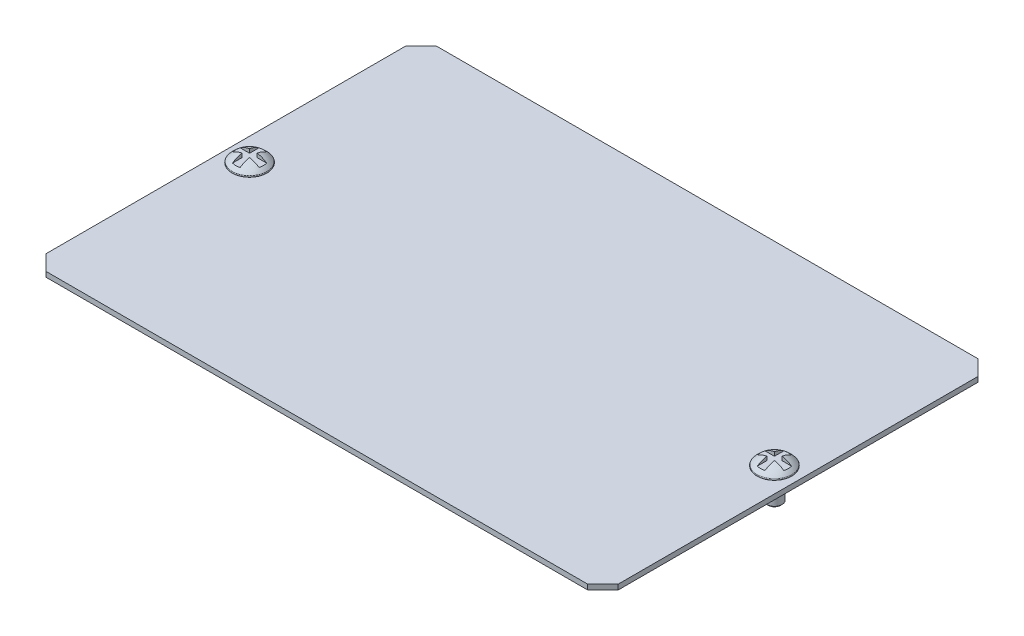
ISO-10303-21;
HEADER;
FILE_DESCRIPTION(('STEP AP214'),'2;1');
FILE_NAME('part.step','',(''),(''),'','','');
FILE_SCHEMA(('AUTOMOTIVE_DESIGN { 1 0 10303 214 1 1 1 1 }'));
ENDSEC;
DATA;
#1=APPLICATION_CONTEXT('core data for automotive mechanical design processes');
#2=APPLICATION_PROTOCOL_DEFINITION('international standard','automotive_design',2000,#1);
#3=PRODUCT_CONTEXT('',#1,'mechanical');
#4=PRODUCT('Part','Part','',(#3));
#5=PRODUCT_RELATED_PRODUCT_CATEGORY('part','',(#4));
#6=PRODUCT_DEFINITION_FORMATION('','',#4);
#7=PRODUCT_DEFINITION_CONTEXT('part definition',#1,'design');
#8=PRODUCT_DEFINITION('design','',#6,#7);
#9=PRODUCT_DEFINITION_SHAPE('','',#8);
#10=(LENGTH_UNIT() NAMED_UNIT(*) SI_UNIT(.MILLI.,.METRE.));
#11=(NAMED_UNIT(*) PLANE_ANGLE_UNIT() SI_UNIT($,.RADIAN.));
#12=(NAMED_UNIT(*) SI_UNIT($,.STERADIAN.) SOLID_ANGLE_UNIT());
#13=UNCERTAINTY_MEASURE_WITH_UNIT(LENGTH_MEASURE(1.E-05),#10,'distance_accuracy_value','');
#14=(GEOMETRIC_REPRESENTATION_CONTEXT(3) GLOBAL_UNCERTAINTY_ASSIGNED_CONTEXT((#13)) GLOBAL_UNIT_ASSIGNED_CONTEXT((#10,
#11,#12)) REPRESENTATION_CONTEXT('',''));
#15=CARTESIAN_POINT('',(0.,0.,0.));
#16=DIRECTION('',(0.,0.,1.));
#17=DIRECTION('',(1.,0.,0.));
#18=AXIS2_PLACEMENT_3D('',#15,#16,#17);
#19=CARTESIAN_POINT('',(0.,1.,0.));
#20=DIRECTION('',(0.,-1.,0.));
#21=DIRECTION('',(0.,0.,-1.));
#22=AXIS2_PLACEMENT_3D('',#19,#20,#21);
#23=PLANE('',#22);
#24=CARTESIAN_POINT('',(51.5,1.,0.));
#25=DIRECTION('',(0.,1.,0.));
#26=DIRECTION('',(1.,0.,0.));
#27=AXIS2_PLACEMENT_3D('',#24,#25,#26);
#28=CIRCLE('',#27,3.23865308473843);
#29=CARTESIAN_POINT('',(54.7386530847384,0.999999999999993,0.));
#30=VERTEX_POINT('',#29);
#31=EDGE_CURVE('E295',#30,#30,#28,.T.);
#32=ORIENTED_EDGE('',*,*,#31,.F.);
#33=EDGE_LOOP('',(#32));
#34=FACE_BOUND('',#33,.T.);
#35=CARTESIAN_POINT('',(-51.4999999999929,1.00000000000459,-1.79184775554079E-12));
#36=DIRECTION('',(0.,1.,0.));
#37=DIRECTION('',(0.,0.,-1.));
#38=AXIS2_PLACEMENT_3D('',#35,#36,#37);
#39=CIRCLE('',#38,3.23865308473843);
#40=CARTESIAN_POINT('',(-51.4999999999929,1.00000000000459,-3.23865308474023));
#41=VERTEX_POINT('',#40);
#42=EDGE_CURVE('E211',#41,#41,#39,.T.);
#43=ORIENTED_EDGE('',*,*,#42,.F.);
#44=EDGE_LOOP('',(#43));
#45=FACE_BOUND('',#44,.T.);
#46=DIRECTION('',(-1.,0.,0.));
#47=VECTOR('',#46,1.);
#48=CARTESIAN_POINT('',(-53.15,1.,-38.3));
#49=LINE('',#48,#47);
#50=CARTESIAN_POINT('',(53.15,1.,-38.3));
#51=VERTEX_POINT('',#50);
#52=CARTESIAN_POINT('',(-53.15,1.,-38.3));
#53=VERTEX_POINT('',#52);
#54=EDGE_CURVE('E130',#51,#53,#49,.T.);
#55=ORIENTED_EDGE('',*,*,#54,.T.);
#56=DIRECTION('',(-0.707106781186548,0.,0.707106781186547));
#57=VECTOR('',#56,1.);
#58=CARTESIAN_POINT('',(-56.15,1.,-35.3));
#59=LINE('',#58,#57);
#60=CARTESIAN_POINT('',(-56.15,1.,-35.3));
#61=VERTEX_POINT('',#60);
#62=EDGE_CURVE('E77',#53,#61,#59,.T.);
#63=ORIENTED_EDGE('',*,*,#62,.T.);
#64=DIRECTION('',(0.,0.,1.));
#65=VECTOR('',#64,1.);
#66=CARTESIAN_POINT('',(-56.15,1.,-35.3));
#67=LINE('',#66,#65);
#68=CARTESIAN_POINT('',(-56.15,1.,35.3));
#69=VERTEX_POINT('',#68);
#70=EDGE_CURVE('E145',#61,#69,#67,.T.);
#71=ORIENTED_EDGE('',*,*,#70,.T.);
#72=DIRECTION('',(0.707106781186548,0.,0.707106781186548));
#73=VECTOR('',#72,1.);
#74=CARTESIAN_POINT('',(-56.15,1.,35.3));
#75=LINE('',#74,#73);
#76=CARTESIAN_POINT('',(-53.15,1.,38.3));
#77=VERTEX_POINT('',#76);
#78=EDGE_CURVE('E158',#69,#77,#75,.T.);
#79=ORIENTED_EDGE('',*,*,#78,.T.);
#80=DIRECTION('',(1.,0.,0.));
#81=VECTOR('',#80,1.);
#82=CARTESIAN_POINT('',(-53.15,1.,38.3));
#83=LINE('',#82,#81);
#84=CARTESIAN_POINT('',(53.15,1.,38.3));
#85=VERTEX_POINT('',#84);
#86=EDGE_CURVE('E97',#77,#85,#83,.T.);
#87=ORIENTED_EDGE('',*,*,#86,.T.);
#88=DIRECTION('',(0.707106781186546,0.,-0.707106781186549));
#89=VECTOR('',#88,1.);
#90=CARTESIAN_POINT('',(53.15,1.,38.3));
#91=LINE('',#90,#89);
#92=CARTESIAN_POINT('',(56.15,1.,35.3));
#93=VERTEX_POINT('',#92);
#94=EDGE_CURVE('E92',#85,#93,#91,.T.);
#95=ORIENTED_EDGE('',*,*,#94,.T.);
#96=DIRECTION('',(0.,0.,-1.));
#97=VECTOR('',#96,1.);
#98=CARTESIAN_POINT('',(56.15,1.,-35.3));
#99=LINE('',#98,#97);
#100=CARTESIAN_POINT('',(56.15,1.,-35.3));
#101=VERTEX_POINT('',#100);
#102=EDGE_CURVE('E95',#93,#101,#99,.T.);
#103=ORIENTED_EDGE('',*,*,#102,.T.);
#104=DIRECTION('',(-0.70710678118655,0.,-0.707106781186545));
#105=VECTOR('',#104,1.);
#106=CARTESIAN_POINT('',(53.15,1.,-38.3));
#107=LINE('',#106,#105);
#108=EDGE_CURVE('E33',#101,#51,#107,.T.);
#109=ORIENTED_EDGE('',*,*,#108,.T.);
#110=EDGE_LOOP('',(#55,#63,#71,#79,#87,#95,#103,#109));
#111=FACE_BOUND('',#110,.T.);
#112=ADVANCED_FACE('F16',(#34,#45,#111),#23,.F.);
#113=CARTESIAN_POINT('',(0.,0.,0.));
#114=DIRECTION('',(0.,-1.,0.));
#115=DIRECTION('',(0.,0.,-1.));
#116=AXIS2_PLACEMENT_3D('',#113,#114,#115);
#117=PLANE('',#116);
#118=CARTESIAN_POINT('',(51.5,0.,0.));
#119=DIRECTION('',(0.,1.,0.));
#120=DIRECTION('',(0.,0.,-1.));
#121=AXIS2_PLACEMENT_3D('',#118,#119,#120);
#122=CIRCLE('',#121,1.9);
#123=CARTESIAN_POINT('',(51.5,0.,-1.90000000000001));
#124=VERTEX_POINT('',#123);
#125=EDGE_CURVE('E119',#124,#124,#122,.T.);
#126=ORIENTED_EDGE('',*,*,#125,.T.);
#127=EDGE_LOOP('',(#126));
#128=FACE_BOUND('',#127,.T.);
#129=DIRECTION('',(-1.,0.,0.));
#130=VECTOR('',#129,1.);
#131=CARTESIAN_POINT('',(-53.15,0.,-38.3));
#132=LINE('',#131,#130);
#133=CARTESIAN_POINT('',(53.15,0.,-38.3));
#134=VERTEX_POINT('',#133);
#135=CARTESIAN_POINT('',(-53.15,0.,-38.3));
#136=VERTEX_POINT('',#135);
#137=EDGE_CURVE('E115',#134,#136,#132,.T.);
#138=ORIENTED_EDGE('',*,*,#137,.F.);
#139=DIRECTION('',(-0.70710678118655,0.,-0.707106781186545));
#140=VECTOR('',#139,1.);
#141=CARTESIAN_POINT('',(53.15,0.,-38.3));
#142=LINE('',#141,#140);
#143=CARTESIAN_POINT('',(56.15,0.,-35.3));
#144=VERTEX_POINT('',#143);
#145=EDGE_CURVE('E69',#144,#134,#142,.T.);
#146=ORIENTED_EDGE('',*,*,#145,.F.);
#147=DIRECTION('',(0.,0.,-1.));
#148=VECTOR('',#147,1.);
#149=CARTESIAN_POINT('',(56.15,0.,-35.3));
#150=LINE('',#149,#148);
#151=CARTESIAN_POINT('',(56.15,0.,35.3));
#152=VERTEX_POINT('',#151);
#153=EDGE_CURVE('E63',#152,#144,#150,.T.);
#154=ORIENTED_EDGE('',*,*,#153,.F.);
#155=DIRECTION('',(0.707106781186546,0.,-0.707106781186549));
#156=VECTOR('',#155,1.);
#157=CARTESIAN_POINT('',(53.15,0.,38.3));
#158=LINE('',#157,#156);
#159=CARTESIAN_POINT('',(53.15,0.,38.3));
#160=VERTEX_POINT('',#159);
#161=EDGE_CURVE('E105',#160,#152,#158,.T.);
#162=ORIENTED_EDGE('',*,*,#161,.F.);
#163=DIRECTION('',(1.,0.,0.));
#164=VECTOR('',#163,1.);
#165=CARTESIAN_POINT('',(-53.15,0.,38.3));
#166=LINE('',#165,#164);
#167=CARTESIAN_POINT('',(-53.15,0.,38.3));
#168=VERTEX_POINT('',#167);
#169=EDGE_CURVE('E125',#168,#160,#166,.T.);
#170=ORIENTED_EDGE('',*,*,#169,.F.);
#171=DIRECTION('',(0.707106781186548,0.,0.707106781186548));
#172=VECTOR('',#171,1.);
#173=CARTESIAN_POINT('',(-56.15,0.,35.3));
#174=LINE('',#173,#172);
#175=CARTESIAN_POINT('',(-56.15,0.,35.3));
#176=VERTEX_POINT('',#175);
#177=EDGE_CURVE('E123',#176,#168,#174,.T.);
#178=ORIENTED_EDGE('',*,*,#177,.F.);
#179=DIRECTION('',(0.,0.,1.));
#180=VECTOR('',#179,1.);
#181=CARTESIAN_POINT('',(-56.15,0.,-35.3));
#182=LINE('',#181,#180);
#183=CARTESIAN_POINT('',(-56.15,0.,-35.3));
#184=VERTEX_POINT('',#183);
#185=EDGE_CURVE('E121',#184,#176,#182,.T.);
#186=ORIENTED_EDGE('',*,*,#185,.F.);
#187=DIRECTION('',(-0.707106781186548,0.,0.707106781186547));
#188=VECTOR('',#187,1.);
#189=CARTESIAN_POINT('',(-56.15,0.,-35.3));
#190=LINE('',#189,#188);
#191=EDGE_CURVE('E118',#136,#184,#190,.T.);
#192=ORIENTED_EDGE('',*,*,#191,.F.);
#193=EDGE_LOOP('',(#138,#146,#154,#162,#170,#178,#186,#192));
#194=FACE_BOUND('',#193,.T.);
#195=CARTESIAN_POINT('',(-51.5,0.,0.));
#196=DIRECTION('',(0.,1.,0.));
#197=DIRECTION('',(0.,0.,1.));
#198=AXIS2_PLACEMENT_3D('',#195,#196,#197);
#199=CIRCLE('',#198,1.9);
#200=CARTESIAN_POINT('',(-51.5,0.,1.9));
#201=VERTEX_POINT('',#200);
#202=EDGE_CURVE('E166',#201,#201,#199,.T.);
#203=ORIENTED_EDGE('',*,*,#202,.T.);
#204=EDGE_LOOP('',(#203));
#205=FACE_BOUND('',#204,.T.);
#206=ADVANCED_FACE('F149',(#128,#194,#205),#117,.T.);
#207=CARTESIAN_POINT('',(-53.15,1.,-38.3));
#208=DIRECTION('',(0.,0.,1.));
#209=DIRECTION('',(1.,0.,0.));
#210=AXIS2_PLACEMENT_3D('',#207,#208,#209);
#211=PLANE('',#210);
#212=ORIENTED_EDGE('',*,*,#137,.T.);
#213=DIRECTION('',(0.,-1.,0.));
#214=VECTOR('',#213,1.);
#215=CARTESIAN_POINT('',(-53.15,1.,-38.3));
#216=LINE('',#215,#214);
#217=EDGE_CURVE('E10',#53,#136,#216,.T.);
#218=ORIENTED_EDGE('',*,*,#217,.F.);
#219=ORIENTED_EDGE('',*,*,#54,.F.);
#220=DIRECTION('',(0.,-1.,0.));
#221=VECTOR('',#220,1.);
#222=CARTESIAN_POINT('',(53.15,1.,-38.3));
#223=LINE('',#222,#221);
#224=EDGE_CURVE('E111',#51,#134,#223,.T.);
#225=ORIENTED_EDGE('',*,*,#224,.T.);
#226=EDGE_LOOP('',(#212,#218,#219,#225));
#227=FACE_BOUND('',#226,.T.);
#228=ADVANCED_FACE('F18',(#227),#211,.F.);
#229=CARTESIAN_POINT('',(-56.15,1.,-35.3));
#230=DIRECTION('',(0.707106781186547,0.,0.707106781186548));
#231=DIRECTION('',(0.707106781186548,0.,-0.707106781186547));
#232=AXIS2_PLACEMENT_3D('',#229,#230,#231);
#233=PLANE('',#232);
#234=ORIENTED_EDGE('',*,*,#191,.T.);
#235=DIRECTION('',(0.,-1.,0.));
#236=VECTOR('',#235,1.);
#237=CARTESIAN_POINT('',(-56.15,1.,-35.3));
#238=LINE('',#237,#236);
#239=EDGE_CURVE('E25',#61,#184,#238,.T.);
#240=ORIENTED_EDGE('',*,*,#239,.F.);
#241=ORIENTED_EDGE('',*,*,#62,.F.);
#242=ORIENTED_EDGE('',*,*,#217,.T.);
#243=EDGE_LOOP('',(#234,#240,#241,#242));
#244=FACE_BOUND('',#243,.T.);
#245=ADVANCED_FACE('F390',(#244),#233,.F.);
#246=CARTESIAN_POINT('',(-56.15,1.,-35.3));
#247=DIRECTION('',(1.,0.,0.));
#248=DIRECTION('',(0.,0.,-1.));
#249=AXIS2_PLACEMENT_3D('',#246,#247,#248);
#250=PLANE('',#249);
#251=ORIENTED_EDGE('',*,*,#185,.T.);
#252=DIRECTION('',(0.,-1.,0.));
#253=VECTOR('',#252,1.);
#254=CARTESIAN_POINT('',(-56.15,1.,35.3));
#255=LINE('',#254,#253);
#256=EDGE_CURVE('E137',#69,#176,#255,.T.);
#257=ORIENTED_EDGE('',*,*,#256,.F.);
#258=ORIENTED_EDGE('',*,*,#70,.F.);
#259=ORIENTED_EDGE('',*,*,#239,.T.);
#260=EDGE_LOOP('',(#251,#257,#258,#259));
#261=FACE_BOUND('',#260,.T.);
#262=ADVANCED_FACE('F143',(#261),#250,.F.);
#263=CARTESIAN_POINT('',(-56.15,1.,35.3));
#264=DIRECTION('',(0.707106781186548,0.,-0.707106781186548));
#265=DIRECTION('',(-0.707106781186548,0.,-0.707106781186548));
#266=AXIS2_PLACEMENT_3D('',#263,#264,#265);
#267=PLANE('',#266);
#268=ORIENTED_EDGE('',*,*,#177,.T.);
#269=DIRECTION('',(0.,-1.,0.));
#270=VECTOR('',#269,1.);
#271=CARTESIAN_POINT('',(-53.15,1.,38.3));
#272=LINE('',#271,#270);
#273=EDGE_CURVE('E134',#77,#168,#272,.T.);
#274=ORIENTED_EDGE('',*,*,#273,.F.);
#275=ORIENTED_EDGE('',*,*,#78,.F.);
#276=ORIENTED_EDGE('',*,*,#256,.T.);
#277=EDGE_LOOP('',(#268,#274,#275,#276));
#278=FACE_BOUND('',#277,.T.);
#279=ADVANCED_FACE('F154',(#278),#267,.F.);
#280=CARTESIAN_POINT('',(-53.15,1.,38.3));
#281=DIRECTION('',(0.,0.,-1.));
#282=DIRECTION('',(-1.,0.,0.));
#283=AXIS2_PLACEMENT_3D('',#280,#281,#282);
#284=PLANE('',#283);
#285=ORIENTED_EDGE('',*,*,#169,.T.);
#286=DIRECTION('',(0.,-1.,0.));
#287=VECTOR('',#286,1.);
#288=CARTESIAN_POINT('',(53.15,1.,38.3));
#289=LINE('',#288,#287);
#290=EDGE_CURVE('E106',#85,#160,#289,.T.);
#291=ORIENTED_EDGE('',*,*,#290,.F.);
#292=ORIENTED_EDGE('',*,*,#86,.F.);
#293=ORIENTED_EDGE('',*,*,#273,.T.);
#294=EDGE_LOOP('',(#285,#291,#292,#293));
#295=FACE_BOUND('',#294,.T.);
#296=ADVANCED_FACE('F157',(#295),#284,.F.);
#297=CARTESIAN_POINT('',(53.15,1.,38.3));
#298=DIRECTION('',(-0.707106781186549,0.,-0.707106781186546));
#299=DIRECTION('',(-0.707106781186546,0.,0.707106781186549));
#300=AXIS2_PLACEMENT_3D('',#297,#298,#299);
#301=PLANE('',#300);
#302=ORIENTED_EDGE('',*,*,#161,.T.);
#303=DIRECTION('',(0.,-1.,0.));
#304=VECTOR('',#303,1.);
#305=CARTESIAN_POINT('',(56.15,1.,35.3));
#306=LINE('',#305,#304);
#307=EDGE_CURVE('E102',#93,#152,#306,.T.);
#308=ORIENTED_EDGE('',*,*,#307,.F.);
#309=ORIENTED_EDGE('',*,*,#94,.F.);
#310=ORIENTED_EDGE('',*,*,#290,.T.);
#311=EDGE_LOOP('',(#302,#308,#309,#310));
#312=FACE_BOUND('',#311,.T.);
#313=ADVANCED_FACE('F103',(#312),#301,.F.);
#314=CARTESIAN_POINT('',(56.15,1.,-35.3));
#315=DIRECTION('',(-1.,0.,0.));
#316=DIRECTION('',(0.,0.,1.));
#317=AXIS2_PLACEMENT_3D('',#314,#315,#316);
#318=PLANE('',#317);
#319=ORIENTED_EDGE('',*,*,#153,.T.);
#320=DIRECTION('',(0.,-1.,0.));
#321=VECTOR('',#320,1.);
#322=CARTESIAN_POINT('',(56.15,1.,-35.3));
#323=LINE('',#322,#321);
#324=EDGE_CURVE('E107',#101,#144,#323,.T.);
#325=ORIENTED_EDGE('',*,*,#324,.F.);
#326=ORIENTED_EDGE('',*,*,#102,.F.);
#327=ORIENTED_EDGE('',*,*,#307,.T.);
#328=EDGE_LOOP('',(#319,#325,#326,#327));
#329=FACE_BOUND('',#328,.T.);
#330=ADVANCED_FACE('F109',(#329),#318,.F.);
#331=CARTESIAN_POINT('',(53.15,1.,-38.3));
#332=DIRECTION('',(-0.707106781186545,0.,0.70710678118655));
#333=DIRECTION('',(0.70710678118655,0.,0.707106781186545));
#334=AXIS2_PLACEMENT_3D('',#331,#332,#333);
#335=PLANE('',#334);
#336=ORIENTED_EDGE('',*,*,#145,.T.);
#337=ORIENTED_EDGE('',*,*,#224,.F.);
#338=ORIENTED_EDGE('',*,*,#108,.F.);
#339=ORIENTED_EDGE('',*,*,#324,.T.);
#340=EDGE_LOOP('',(#336,#337,#338,#339));
#341=FACE_BOUND('',#340,.T.);
#342=ADVANCED_FACE('F378',(#341),#335,.F.);
#343=CARTESIAN_POINT('',(51.5,1.,0.));
#344=DIRECTION('',(0.,-1.,0.));
#345=DIRECTION('',(0.,0.,-1.));
#346=AXIS2_PLACEMENT_3D('',#343,#344,#345);
#347=CYLINDRICAL_SURFACE('',#346,1.9);
#348=CARTESIAN_POINT('',(51.5,1.,0.));
#349=DIRECTION('',(0.,1.,0.));
#350=DIRECTION('',(-1.,0.,0.));
#351=AXIS2_PLACEMENT_3D('',#348,#349,#350);
#352=CIRCLE('',#351,1.9);
#353=CARTESIAN_POINT('',(49.6,1.,0.));
#354=VERTEX_POINT('',#353);
#355=EDGE_CURVE('E253',#354,#354,#352,.T.);
#356=ORIENTED_EDGE('',*,*,#355,.T.);
#357=EDGE_LOOP('',(#356));
#358=FACE_BOUND('',#357,.T.);
#359=ORIENTED_EDGE('',*,*,#125,.F.);
#360=EDGE_LOOP('',(#359));
#361=FACE_BOUND('',#360,.T.);
#362=ADVANCED_FACE('F375',(#358,#361),#347,.F.);
#363=CARTESIAN_POINT('',(-51.5,1.,0.));
#364=DIRECTION('',(0.,-1.,0.));
#365=DIRECTION('',(0.,0.,-1.));
#366=AXIS2_PLACEMENT_3D('',#363,#364,#365);
#367=CYLINDRICAL_SURFACE('',#366,1.9);
#368=CARTESIAN_POINT('',(-51.5,1.00000000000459,0.));
#369=DIRECTION('',(0.,1.,0.));
#370=DIRECTION('',(-1.,0.,0.));
#371=AXIS2_PLACEMENT_3D('',#368,#369,#370);
#372=CIRCLE('',#371,1.9);
#373=CARTESIAN_POINT('',(-53.4,1.0000000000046,0.));
#374=VERTEX_POINT('',#373);
#375=EDGE_CURVE('E169',#374,#374,#372,.T.);
#376=ORIENTED_EDGE('',*,*,#375,.T.);
#377=EDGE_LOOP('',(#376));
#378=FACE_BOUND('',#377,.T.);
#379=ORIENTED_EDGE('',*,*,#202,.F.);
#380=EDGE_LOOP('',(#379));
#381=FACE_BOUND('',#380,.T.);
#382=ADVANCED_FACE('F465',(#378,#381),#367,.F.);
#383=CARTESIAN_POINT('',(-51.499999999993,-4.69999999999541,-1.7882784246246E-12));
#384=DIRECTION('',(0.,1.,0.));
#385=DIRECTION('',(0.,0.,-1.));
#386=AXIS2_PLACEMENT_3D('',#383,#384,#385);
#387=CONICAL_SURFACE('',#386,1.5,0.78539816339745);
#388=CARTESIAN_POINT('',(-51.499999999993,-4.99999999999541,-1.7880905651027E-12));
#389=DIRECTION('',(0.,1.,0.));
#390=DIRECTION('',(0.,0.,-1.));
#391=AXIS2_PLACEMENT_3D('',#388,#389,#390);
#392=CIRCLE('',#391,1.2);
#393=CARTESIAN_POINT('',(-51.499999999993,-4.99999999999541,-1.20000000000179));
#394=VERTEX_POINT('',#393);
#395=EDGE_CURVE('E172',#394,#394,#392,.F.);
#396=ORIENTED_EDGE('',*,*,#395,.F.);
#397=EDGE_LOOP('',(#396));
#398=FACE_BOUND('',#397,.T.);
#399=CARTESIAN_POINT('',(-51.499999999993,-4.69999999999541,-1.7882784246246E-12));
#400=DIRECTION('',(0.,1.,0.));
#401=DIRECTION('',(0.,0.,-1.));
#402=AXIS2_PLACEMENT_3D('',#399,#400,#401);
#403=CIRCLE('',#402,1.5);
#404=CARTESIAN_POINT('',(-51.499999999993,-4.69999999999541,-1.50000000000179));
#405=VERTEX_POINT('',#404);
#406=EDGE_CURVE('E175',#405,#405,#403,.T.);
#407=ORIENTED_EDGE('',*,*,#406,.F.);
#408=EDGE_LOOP('',(#407));
#409=FACE_BOUND('',#408,.T.);
#410=ADVANCED_FACE('F472',(#398,#409),#387,.T.);
#411=CARTESIAN_POINT('',(-51.4999999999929,1.00000000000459,1.49999999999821));
#412=DIRECTION('',(0.,1.,0.));
#413=DIRECTION('',(0.,0.,-1.));
#414=AXIS2_PLACEMENT_3D('',#411,#412,#413);
#415=PLANE('',#414);
#416=ORIENTED_EDGE('',*,*,#375,.F.);
#417=EDGE_LOOP('',(#416));
#418=FACE_BOUND('',#417,.T.);
#419=CARTESIAN_POINT('',(-51.4999999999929,1.00000000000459,-1.79184775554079E-12));
#420=DIRECTION('',(0.,1.,0.));
#421=DIRECTION('',(0.,0.,-1.));
#422=AXIS2_PLACEMENT_3D('',#419,#420,#421);
#423=CIRCLE('',#422,1.5);
#424=CARTESIAN_POINT('',(-51.4999999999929,1.00000000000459,-1.50000000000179));
#425=VERTEX_POINT('',#424);
#426=EDGE_CURVE('E208',#425,#425,#423,.T.);
#427=ORIENTED_EDGE('',*,*,#426,.T.);
#428=EDGE_LOOP('',(#427));
#429=FACE_BOUND('',#428,.T.);
#430=ADVANCED_FACE('F480',(#418,#429),#415,.F.);
#431=CARTESIAN_POINT('',(-51.4999999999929,2.90000000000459,-1.79303753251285E-12));
#432=DIRECTION('',(0.,1.,0.));
#433=DIRECTION('',(0.,0.,-1.));
#434=AXIS2_PLACEMENT_3D('',#431,#432,#433);
#435=CYLINDRICAL_SURFACE('',#434,1.5);
#436=ORIENTED_EDGE('',*,*,#406,.T.);
#437=EDGE_LOOP('',(#436));
#438=FACE_BOUND('',#437,.T.);
#439=ORIENTED_EDGE('',*,*,#426,.F.);
#440=EDGE_LOOP('',(#439));
#441=FACE_BOUND('',#440,.T.);
#442=ADVANCED_FACE('F489',(#438,#441),#435,.T.);
#443=CARTESIAN_POINT('',(-51.499999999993,-4.99999999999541,-1.7880905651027E-12));
#444=DIRECTION('',(0.,1.,0.));
#445=DIRECTION('',(0.,0.,-1.));
#446=AXIS2_PLACEMENT_3D('',#443,#444,#445);
#447=PLANE('',#446);
#448=ORIENTED_EDGE('',*,*,#395,.T.);
#449=EDGE_LOOP('',(#448));
#450=FACE_BOUND('',#449,.T.);
#451=ADVANCED_FACE('F498',(#450),#447,.F.);
#452=CARTESIAN_POINT('',(-51.499999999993,-1.59999999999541,-1.79053587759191E-12));
#453=DIRECTION('',(0.,1.,0.));
#454=DIRECTION('',(0.,0.,1.));
#455=AXIS2_PLACEMENT_3D('',#452,#453,#454);
#456=SPHERICAL_SURFACE('',#455,4.5);
#457=CARTESIAN_POINT('',(-51.4999999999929,1.34989146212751,-1.79206685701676E-12));
#458=DIRECTION('',(0.,1.,0.));
#459=DIRECTION('',(0.,0.,-1.));
#460=AXIS2_PLACEMENT_3D('',#457,#458,#459);
#461=CIRCLE('',#460,3.39825548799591);
#462=CARTESIAN_POINT('',(-51.4999999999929,1.34989146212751,-3.3982554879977));
#463=VERTEX_POINT('',#462);
#464=EDGE_CURVE('E214',#463,#463,#461,.T.);
#465=ORIENTED_EDGE('',*,*,#464,.T.);
#466=EDGE_LOOP('',(#465));
#467=FACE_BOUND('',#466,.T.);
#468=CARTESIAN_POINT('',(-51.499999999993,-1.59999999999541,-0.750000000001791));
#469=DIRECTION('',(0.,0.,1.));
#470=DIRECTION('',(1.,0.,0.));
#471=AXIS2_PLACEMENT_3D('',#468,#469,#470);
#472=CIRCLE('',#471,4.43705983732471);
#473=CARTESIAN_POINT('',(-48.9062575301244,2.00000000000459,-0.750000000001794));
#474=VERTEX_POINT('',#473);
#475=CARTESIAN_POINT('',(-50.7499999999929,2.77321392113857,-0.750000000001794));
#476=VERTEX_POINT('',#475);
#477=EDGE_CURVE('E178',#474,#476,#472,.T.);
#478=ORIENTED_EDGE('',*,*,#477,.F.);
#479=CARTESIAN_POINT('',(-51.4999999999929,2.00000000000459,-1.79268415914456E-12));
#480=DIRECTION('',(0.,-1.,0.));
#481=DIRECTION('',(0.,0.,1.));
#482=AXIS2_PLACEMENT_3D('',#479,#480,#481);
#483=CIRCLE('',#482,2.7);
#484=CARTESIAN_POINT('',(-48.9062575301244,2.00000000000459,0.749999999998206));
#485=VERTEX_POINT('',#484);
#486=EDGE_CURVE('E188',#474,#485,#483,.T.);
#487=ORIENTED_EDGE('',*,*,#486,.T.);
#488=CARTESIAN_POINT('',(-51.499999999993,-1.59999999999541,0.749999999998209));
#489=DIRECTION('',(0.,0.,-1.));
#490=DIRECTION('',(-1.,0.,0.));
#491=AXIS2_PLACEMENT_3D('',#488,#489,#490);
#492=CIRCLE('',#491,4.43705983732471);
#493=CARTESIAN_POINT('',(-50.7499999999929,2.77321392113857,0.749999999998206));
#494=VERTEX_POINT('',#493);
#495=EDGE_CURVE('E185',#494,#485,#492,.T.);
#496=ORIENTED_EDGE('',*,*,#495,.F.);
#497=CARTESIAN_POINT('',(-50.749999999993,-1.59999999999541,-1.79058271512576E-12));
#498=DIRECTION('',(-1.,0.,0.));
#499=DIRECTION('',(0.,0.,1.));
#500=AXIS2_PLACEMENT_3D('',#497,#498,#499);
#501=CIRCLE('',#500,4.43705983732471);
#502=CARTESIAN_POINT('',(-50.7499999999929,2.00000000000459,2.59374246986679));
#503=VERTEX_POINT('',#502);
#504=EDGE_CURVE('E196',#503,#494,#501,.T.);
#505=ORIENTED_EDGE('',*,*,#504,.F.);
#506=CARTESIAN_POINT('',(-52.2499999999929,2.0000000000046,2.59374246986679));
#507=VERTEX_POINT('',#506);
#508=EDGE_CURVE('E205',#503,#507,#483,.T.);
#509=ORIENTED_EDGE('',*,*,#508,.T.);
#510=CARTESIAN_POINT('',(-52.249999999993,-1.59999999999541,-1.79012763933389E-12));
#511=DIRECTION('',(1.,0.,0.));
#512=DIRECTION('',(0.,0.,-1.));
#513=AXIS2_PLACEMENT_3D('',#510,#511,#512);
#514=CIRCLE('',#513,4.43705983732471);
#515=CARTESIAN_POINT('',(-52.2499999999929,2.77321392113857,0.749999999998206));
#516=VERTEX_POINT('',#515);
#517=EDGE_CURVE('E202',#516,#507,#514,.T.);
#518=ORIENTED_EDGE('',*,*,#517,.F.);
#519=CARTESIAN_POINT('',(-51.499999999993,-1.59999999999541,0.749999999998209));
#520=DIRECTION('',(0.,0.,-1.));
#521=DIRECTION('',(-1.,0.,0.));
#522=AXIS2_PLACEMENT_3D('',#519,#520,#521);
#523=CIRCLE('',#522,4.43705983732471);
#524=CARTESIAN_POINT('',(-54.0937424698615,2.0000000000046,0.749999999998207));
#525=VERTEX_POINT('',#524);
#526=EDGE_CURVE('E199',#525,#516,#523,.T.);
#527=ORIENTED_EDGE('',*,*,#526,.F.);
#528=CARTESIAN_POINT('',(-54.0937424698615,2.0000000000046,-0.750000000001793));
#529=VERTEX_POINT('',#528);
#530=EDGE_CURVE('E195',#525,#529,#483,.T.);
#531=ORIENTED_EDGE('',*,*,#530,.T.);
#532=CARTESIAN_POINT('',(-51.499999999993,-1.59999999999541,-0.750000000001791));
#533=DIRECTION('',(0.,0.,1.));
#534=DIRECTION('',(1.,0.,0.));
#535=AXIS2_PLACEMENT_3D('',#532,#533,#534);
#536=CIRCLE('',#535,4.43705983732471);
#537=CARTESIAN_POINT('',(-52.2499999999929,2.77321392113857,-0.750000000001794));
#538=VERTEX_POINT('',#537);
#539=EDGE_CURVE('E192',#538,#529,#536,.T.);
#540=ORIENTED_EDGE('',*,*,#539,.F.);
#541=CARTESIAN_POINT('',(-52.249999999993,-1.59999999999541,-1.79085044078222E-12));
#542=DIRECTION('',(1.,0.,0.));
#543=DIRECTION('',(0.,0.,-1.));
#544=AXIS2_PLACEMENT_3D('',#541,#542,#543);
#545=CIRCLE('',#544,4.43705983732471);
#546=CARTESIAN_POINT('',(-52.2499999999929,2.00000000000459,-2.59374246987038));
#547=VERTEX_POINT('',#546);
#548=EDGE_CURVE('E189',#547,#538,#545,.T.);
#549=ORIENTED_EDGE('',*,*,#548,.F.);
#550=CARTESIAN_POINT('',(-50.7499999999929,2.00000000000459,-2.59374246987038));
#551=VERTEX_POINT('',#550);
#552=EDGE_CURVE('E184',#547,#551,#483,.T.);
#553=ORIENTED_EDGE('',*,*,#552,.T.);
#554=CARTESIAN_POINT('',(-50.749999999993,-1.59999999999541,-1.79058271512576E-12));
#555=DIRECTION('',(-1.,0.,0.));
#556=DIRECTION('',(0.,0.,1.));
#557=AXIS2_PLACEMENT_3D('',#554,#555,#556);
#558=CIRCLE('',#557,4.43705983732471);
#559=EDGE_CURVE('E181',#476,#551,#558,.T.);
#560=ORIENTED_EDGE('',*,*,#559,.F.);
#561=EDGE_LOOP('',(#478,#487,#496,#505,#509,#518,#527,#531,#540,#549,#553,#560));
#562=FACE_BOUND('',#561,.T.);
#563=ADVANCED_FACE('F507',(#467,#562),#456,.T.);
#564=CARTESIAN_POINT('',(-51.4999999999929,1.21134691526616,-1.79205939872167E-12));
#565=DIRECTION('',(0.,1.,0.));
#566=DIRECTION('',(0.,0.,-1.));
#567=AXIS2_PLACEMENT_3D('',#564,#565,#566);
#568=TOROIDAL_SURFACE('',#567,3.23865308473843,0.211346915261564);
#569=ORIENTED_EDGE('',*,*,#464,.F.);
#570=EDGE_LOOP('',(#569));
#571=FACE_BOUND('',#570,.T.);
#572=ORIENTED_EDGE('',*,*,#42,.T.);
#573=EDGE_LOOP('',(#572));
#574=FACE_BOUND('',#573,.T.);
#575=ADVANCED_FACE('F516',(#571,#574),#568,.T.);
#576=CARTESIAN_POINT('',(-50.7499999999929,2.90000000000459,2.9999999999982));
#577=DIRECTION('',(-1.,0.,0.));
#578=DIRECTION('',(0.,0.,1.));
#579=AXIS2_PLACEMENT_3D('',#576,#577,#578);
#580=PLANE('',#579);
#581=ORIENTED_EDGE('',*,*,#504,.T.);
#582=DIRECTION('',(0.,-1.,0.));
#583=VECTOR('',#582,1.);
#584=CARTESIAN_POINT('',(-50.7499999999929,2.90000000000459,0.749999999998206));
#585=LINE('',#584,#583);
#586=CARTESIAN_POINT('',(-50.7499999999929,2.00000000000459,0.749999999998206));
#587=VERTEX_POINT('',#586);
#588=EDGE_CURVE('E217',#494,#587,#585,.T.);
#589=ORIENTED_EDGE('',*,*,#588,.T.);
#590=DIRECTION('',(0.,0.,-1.));
#591=VECTOR('',#590,1.);
#592=CARTESIAN_POINT('',(-50.7499999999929,2.00000000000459,2.9999999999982));
#593=LINE('',#592,#591);
#594=EDGE_CURVE('E250',#503,#587,#593,.T.);
#595=ORIENTED_EDGE('',*,*,#594,.F.);
#596=EDGE_LOOP('',(#581,#589,#595));
#597=FACE_BOUND('',#596,.T.);
#598=ADVANCED_FACE('F525',(#597),#580,.T.);
#599=CARTESIAN_POINT('',(-50.7499999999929,2.90000000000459,0.749999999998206));
#600=DIRECTION('',(0.,0.,-1.));
#601=DIRECTION('',(-1.,0.,0.));
#602=AXIS2_PLACEMENT_3D('',#599,#600,#601);
#603=PLANE('',#602);
#604=ORIENTED_EDGE('',*,*,#495,.T.);
#605=DIRECTION('',(1.,0.,0.));
#606=VECTOR('',#605,1.);
#607=CARTESIAN_POINT('',(-50.7499999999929,2.00000000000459,0.749999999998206));
#608=LINE('',#607,#606);
#609=EDGE_CURVE('E247',#587,#485,#608,.T.);
#610=ORIENTED_EDGE('',*,*,#609,.F.);
#611=ORIENTED_EDGE('',*,*,#588,.F.);
#612=EDGE_LOOP('',(#604,#610,#611));
#613=FACE_BOUND('',#612,.T.);
#614=ADVANCED_FACE('F534',(#613),#603,.T.);
#615=CARTESIAN_POINT('',(-50.7499999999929,2.90000000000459,-0.750000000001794));
#616=DIRECTION('',(0.,0.,1.));
#617=DIRECTION('',(1.,0.,0.));
#618=AXIS2_PLACEMENT_3D('',#615,#616,#617);
#619=PLANE('',#618);
#620=ORIENTED_EDGE('',*,*,#477,.T.);
#621=DIRECTION('',(0.,-1.,0.));
#622=VECTOR('',#621,1.);
#623=CARTESIAN_POINT('',(-50.7499999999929,2.90000000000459,-0.750000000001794));
#624=LINE('',#623,#622);
#625=CARTESIAN_POINT('',(-50.7499999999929,2.00000000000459,-0.750000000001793));
#626=VERTEX_POINT('',#625);
#627=EDGE_CURVE('E220',#476,#626,#624,.T.);
#628=ORIENTED_EDGE('',*,*,#627,.T.);
#629=DIRECTION('',(-1.,0.,0.));
#630=VECTOR('',#629,1.);
#631=CARTESIAN_POINT('',(-50.7499999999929,2.00000000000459,-0.750000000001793));
#632=LINE('',#631,#630);
#633=EDGE_CURVE('E244',#474,#626,#632,.T.);
#634=ORIENTED_EDGE('',*,*,#633,.F.);
#635=EDGE_LOOP('',(#620,#628,#634));
#636=FACE_BOUND('',#635,.T.);
#637=ADVANCED_FACE('F543',(#636),#619,.T.);
#638=CARTESIAN_POINT('',(-50.7499999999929,2.90000000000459,-3.0000000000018));
#639=DIRECTION('',(-1.,0.,0.));
#640=DIRECTION('',(0.,0.,1.));
#641=AXIS2_PLACEMENT_3D('',#638,#639,#640);
#642=PLANE('',#641);
#643=ORIENTED_EDGE('',*,*,#559,.T.);
#644=DIRECTION('',(0.,0.,-1.));
#645=VECTOR('',#644,1.);
#646=CARTESIAN_POINT('',(-50.7499999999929,2.00000000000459,-3.0000000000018));
#647=LINE('',#646,#645);
#648=EDGE_CURVE('E241',#626,#551,#647,.T.);
#649=ORIENTED_EDGE('',*,*,#648,.F.);
#650=ORIENTED_EDGE('',*,*,#627,.F.);
#651=EDGE_LOOP('',(#643,#649,#650));
#652=FACE_BOUND('',#651,.T.);
#653=ADVANCED_FACE('F552',(#652),#642,.T.);
#654=CARTESIAN_POINT('',(-52.2499999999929,2.90000000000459,-3.0000000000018));
#655=DIRECTION('',(1.,0.,0.));
#656=DIRECTION('',(0.,0.,-1.));
#657=AXIS2_PLACEMENT_3D('',#654,#655,#656);
#658=PLANE('',#657);
#659=ORIENTED_EDGE('',*,*,#548,.T.);
#660=DIRECTION('',(0.,-1.,0.));
#661=VECTOR('',#660,1.);
#662=CARTESIAN_POINT('',(-52.2499999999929,2.90000000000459,-0.750000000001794));
#663=LINE('',#662,#661);
#664=CARTESIAN_POINT('',(-52.2499999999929,2.00000000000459,-0.750000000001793));
#665=VERTEX_POINT('',#664);
#666=EDGE_CURVE('E223',#538,#665,#663,.T.);
#667=ORIENTED_EDGE('',*,*,#666,.T.);
#668=DIRECTION('',(0.,0.,1.));
#669=VECTOR('',#668,1.);
#670=CARTESIAN_POINT('',(-52.2499999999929,2.00000000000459,-3.0000000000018));
#671=LINE('',#670,#669);
#672=EDGE_CURVE('E238',#547,#665,#671,.T.);
#673=ORIENTED_EDGE('',*,*,#672,.F.);
#674=EDGE_LOOP('',(#659,#667,#673));
#675=FACE_BOUND('',#674,.T.);
#676=ADVANCED_FACE('F561',(#675),#658,.T.);
#677=CARTESIAN_POINT('',(-52.2499999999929,2.90000000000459,-0.750000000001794));
#678=DIRECTION('',(0.,0.,1.));
#679=DIRECTION('',(1.,0.,0.));
#680=AXIS2_PLACEMENT_3D('',#677,#678,#679);
#681=PLANE('',#680);
#682=ORIENTED_EDGE('',*,*,#539,.T.);
#683=DIRECTION('',(-1.,0.,0.));
#684=VECTOR('',#683,1.);
#685=CARTESIAN_POINT('',(-52.2499999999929,2.00000000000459,-0.750000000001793));
#686=LINE('',#685,#684);
#687=EDGE_CURVE('E235',#665,#529,#686,.T.);
#688=ORIENTED_EDGE('',*,*,#687,.F.);
#689=ORIENTED_EDGE('',*,*,#666,.F.);
#690=EDGE_LOOP('',(#682,#688,#689));
#691=FACE_BOUND('',#690,.T.);
#692=ADVANCED_FACE('F570',(#691),#681,.T.);
#693=CARTESIAN_POINT('',(-52.2499999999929,2.90000000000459,0.749999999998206));
#694=DIRECTION('',(0.,0.,-1.));
#695=DIRECTION('',(-1.,0.,0.));
#696=AXIS2_PLACEMENT_3D('',#693,#694,#695);
#697=PLANE('',#696);
#698=ORIENTED_EDGE('',*,*,#526,.T.);
#699=DIRECTION('',(0.,-1.,0.));
#700=VECTOR('',#699,1.);
#701=CARTESIAN_POINT('',(-52.2499999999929,2.90000000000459,0.749999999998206));
#702=LINE('',#701,#700);
#703=CARTESIAN_POINT('',(-52.2499999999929,2.00000000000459,0.749999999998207));
#704=VERTEX_POINT('',#703);
#705=EDGE_CURVE('E226',#516,#704,#702,.T.);
#706=ORIENTED_EDGE('',*,*,#705,.T.);
#707=DIRECTION('',(1.,0.,0.));
#708=VECTOR('',#707,1.);
#709=CARTESIAN_POINT('',(-52.2499999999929,2.00000000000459,0.749999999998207));
#710=LINE('',#709,#708);
#711=EDGE_CURVE('E232',#525,#704,#710,.T.);
#712=ORIENTED_EDGE('',*,*,#711,.F.);
#713=EDGE_LOOP('',(#698,#706,#712));
#714=FACE_BOUND('',#713,.T.);
#715=ADVANCED_FACE('F579',(#714),#697,.T.);
#716=CARTESIAN_POINT('',(-52.2499999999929,2.9000000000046,2.9999999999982));
#717=DIRECTION('',(1.,0.,0.));
#718=DIRECTION('',(0.,0.,-1.));
#719=AXIS2_PLACEMENT_3D('',#716,#717,#718);
#720=PLANE('',#719);
#721=ORIENTED_EDGE('',*,*,#517,.T.);
#722=DIRECTION('',(0.,0.,1.));
#723=VECTOR('',#722,1.);
#724=CARTESIAN_POINT('',(-52.2499999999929,2.0000000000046,2.9999999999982));
#725=LINE('',#724,#723);
#726=EDGE_CURVE('E229',#704,#507,#725,.T.);
#727=ORIENTED_EDGE('',*,*,#726,.F.);
#728=ORIENTED_EDGE('',*,*,#705,.F.);
#729=EDGE_LOOP('',(#721,#727,#728));
#730=FACE_BOUND('',#729,.T.);
#731=ADVANCED_FACE('F588',(#730),#720,.T.);
#732=CARTESIAN_POINT('',(-51.4999999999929,2.00000000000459,-1.79339738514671E-12));
#733=DIRECTION('',(0.,-1.,0.));
#734=DIRECTION('',(0.,0.,1.));
#735=AXIS2_PLACEMENT_3D('',#732,#733,#734);
#736=PLANE('',#735);
#737=ORIENTED_EDGE('',*,*,#711,.T.);
#738=ORIENTED_EDGE('',*,*,#726,.T.);
#739=ORIENTED_EDGE('',*,*,#508,.F.);
#740=ORIENTED_EDGE('',*,*,#594,.T.);
#741=ORIENTED_EDGE('',*,*,#609,.T.);
#742=ORIENTED_EDGE('',*,*,#486,.F.);
#743=ORIENTED_EDGE('',*,*,#633,.T.);
#744=ORIENTED_EDGE('',*,*,#648,.T.);
#745=ORIENTED_EDGE('',*,*,#552,.F.);
#746=ORIENTED_EDGE('',*,*,#672,.T.);
#747=ORIENTED_EDGE('',*,*,#687,.T.);
#748=ORIENTED_EDGE('',*,*,#530,.F.);
#749=EDGE_LOOP('',(#737,#738,#739,#740,#741,#742,#743,#744,#745,#746,#747,#748));
#750=FACE_BOUND('',#749,.T.);
#751=ADVANCED_FACE('F344',(#750),#736,.F.);
#752=CARTESIAN_POINT('',(51.5,-4.7,0.));
#753=DIRECTION('',(0.,1.,0.));
#754=DIRECTION('',(1.,0.,0.));
#755=AXIS2_PLACEMENT_3D('',#752,#753,#754);
#756=CONICAL_SURFACE('',#755,1.5,0.78539816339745);
#757=CARTESIAN_POINT('',(51.5,-5.,0.));
#758=DIRECTION('',(0.,1.,0.));
#759=DIRECTION('',(1.,0.,0.));
#760=AXIS2_PLACEMENT_3D('',#757,#758,#759);
#761=CIRCLE('',#760,1.2);
#762=CARTESIAN_POINT('',(52.7,-5.,0.));
#763=VERTEX_POINT('',#762);
#764=EDGE_CURVE('E334',#763,#763,#761,.F.);
#765=ORIENTED_EDGE('',*,*,#764,.F.);
#766=EDGE_LOOP('',(#765));
#767=FACE_BOUND('',#766,.T.);
#768=CARTESIAN_POINT('',(51.5,-4.7,0.));
#769=DIRECTION('',(0.,1.,0.));
#770=DIRECTION('',(1.,0.,0.));
#771=AXIS2_PLACEMENT_3D('',#768,#769,#770);
#772=CIRCLE('',#771,1.5);
#773=CARTESIAN_POINT('',(53.,-4.7,0.));
#774=VERTEX_POINT('',#773);
#775=EDGE_CURVE('E331',#774,#774,#772,.T.);
#776=ORIENTED_EDGE('',*,*,#775,.F.);
#777=EDGE_LOOP('',(#776));
#778=FACE_BOUND('',#777,.T.);
#779=ADVANCED_FACE('F340',(#767,#778),#756,.T.);
#780=CARTESIAN_POINT('',(50.,1.,0.));
#781=DIRECTION('',(0.,1.,0.));
#782=DIRECTION('',(1.,0.,0.));
#783=AXIS2_PLACEMENT_3D('',#780,#781,#782);
#784=PLANE('',#783);
#785=ORIENTED_EDGE('',*,*,#355,.F.);
#786=EDGE_LOOP('',(#785));
#787=FACE_BOUND('',#786,.T.);
#788=CARTESIAN_POINT('',(51.5,1.,0.));
#789=DIRECTION('',(0.,1.,0.));
#790=DIRECTION('',(1.,0.,0.));
#791=AXIS2_PLACEMENT_3D('',#788,#789,#790);
#792=CIRCLE('',#791,1.5);
#793=CARTESIAN_POINT('',(53.,0.999999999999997,0.));
#794=VERTEX_POINT('',#793);
#795=EDGE_CURVE('E298',#794,#794,#792,.T.);
#796=ORIENTED_EDGE('',*,*,#795,.T.);
#797=EDGE_LOOP('',(#796));
#798=FACE_BOUND('',#797,.T.);
#799=ADVANCED_FACE('F343',(#787,#798),#784,.F.);
#800=CARTESIAN_POINT('',(51.5,2.9,0.));
#801=DIRECTION('',(0.,1.,0.));
#802=DIRECTION('',(1.,0.,0.));
#803=AXIS2_PLACEMENT_3D('',#800,#801,#802);
#804=CYLINDRICAL_SURFACE('',#803,1.5);
#805=ORIENTED_EDGE('',*,*,#775,.T.);
#806=EDGE_LOOP('',(#805));
#807=FACE_BOUND('',#806,.T.);
#808=ORIENTED_EDGE('',*,*,#795,.F.);
#809=EDGE_LOOP('',(#808));
#810=FACE_BOUND('',#809,.T.);
#811=ADVANCED_FACE('F348',(#807,#810),#804,.T.);
#812=CARTESIAN_POINT('',(51.5,-5.,0.));
#813=DIRECTION('',(0.,1.,0.));
#814=DIRECTION('',(1.,0.,0.));
#815=AXIS2_PLACEMENT_3D('',#812,#813,#814);
#816=PLANE('',#815);
#817=ORIENTED_EDGE('',*,*,#764,.T.);
#818=EDGE_LOOP('',(#817));
#819=FACE_BOUND('',#818,.T.);
#820=ADVANCED_FACE('F338',(#819),#816,.F.);
#821=CARTESIAN_POINT('',(51.5,-1.6,0.));
#822=DIRECTION('',(0.,1.,0.));
#823=DIRECTION('',(-1.,0.,0.));
#824=AXIS2_PLACEMENT_3D('',#821,#822,#823);
#825=SPHERICAL_SURFACE('',#824,4.5);
#826=CARTESIAN_POINT('',(51.5,1.34989146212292,0.));
#827=DIRECTION('',(0.,1.,0.));
#828=DIRECTION('',(1.,0.,0.));
#829=AXIS2_PLACEMENT_3D('',#826,#827,#828);
#830=CIRCLE('',#829,3.39825548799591);
#831=CARTESIAN_POINT('',(54.8982554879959,1.34989146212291,0.));
#832=VERTEX_POINT('',#831);
#833=EDGE_CURVE('E292',#832,#832,#830,.T.);
#834=ORIENTED_EDGE('',*,*,#833,.T.);
#835=EDGE_LOOP('',(#834));
#836=FACE_BOUND('',#835,.T.);
#837=CARTESIAN_POINT('',(52.25,-1.6,0.));
#838=DIRECTION('',(-1.,0.,0.));
#839=DIRECTION('',(0.,0.,1.));
#840=AXIS2_PLACEMENT_3D('',#837,#838,#839);
#841=CIRCLE('',#840,4.43705983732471);
#842=CARTESIAN_POINT('',(52.25,2.,2.59374246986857));
#843=VERTEX_POINT('',#842);
#844=CARTESIAN_POINT('',(52.25,2.77321392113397,0.749999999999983));
#845=VERTEX_POINT('',#844);
#846=EDGE_CURVE('E328',#843,#845,#841,.T.);
#847=ORIENTED_EDGE('',*,*,#846,.F.);
#848=CARTESIAN_POINT('',(51.5,2.,0.));
#849=DIRECTION('',(0.,-1.,0.));
#850=DIRECTION('',(-1.,0.,0.));
#851=AXIS2_PLACEMENT_3D('',#848,#849,#850);
#852=CIRCLE('',#851,2.7);
#853=CARTESIAN_POINT('',(50.75,2.,2.59374246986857));
#854=VERTEX_POINT('',#853);
#855=EDGE_CURVE('E324',#843,#854,#852,.T.);
#856=ORIENTED_EDGE('',*,*,#855,.T.);
#857=CARTESIAN_POINT('',(50.75,-1.6,0.));
#858=DIRECTION('',(1.,0.,0.));
#859=DIRECTION('',(0.,0.,-1.));
#860=AXIS2_PLACEMENT_3D('',#857,#858,#859);
#861=CIRCLE('',#860,4.43705983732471);
#862=CARTESIAN_POINT('',(50.75,2.77321392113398,0.749999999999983));
#863=VERTEX_POINT('',#862);
#864=EDGE_CURVE('E321',#863,#854,#861,.T.);
#865=ORIENTED_EDGE('',*,*,#864,.F.);
#866=CARTESIAN_POINT('',(51.5,-1.6,0.749999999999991));
#867=DIRECTION('',(0.,0.,-1.));
#868=DIRECTION('',(-1.,0.,0.));
#869=AXIS2_PLACEMENT_3D('',#866,#867,#868);
#870=CIRCLE('',#869,4.43705983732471);
#871=CARTESIAN_POINT('',(48.9062575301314,2.,0.749999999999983));
#872=VERTEX_POINT('',#871);
#873=EDGE_CURVE('E312',#872,#863,#870,.T.);
#874=ORIENTED_EDGE('',*,*,#873,.F.);
#875=CARTESIAN_POINT('',(48.9062575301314,2.,-0.750000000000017));
#876=VERTEX_POINT('',#875);
#877=EDGE_CURVE('E301',#872,#876,#852,.T.);
#878=ORIENTED_EDGE('',*,*,#877,.T.);
#879=CARTESIAN_POINT('',(51.5,-1.6,-0.75000000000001));
#880=DIRECTION('',(0.,0.,1.));
#881=DIRECTION('',(1.,0.,0.));
#882=AXIS2_PLACEMENT_3D('',#879,#880,#881);
#883=CIRCLE('',#882,4.43705983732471);
#884=CARTESIAN_POINT('',(50.75,2.77321392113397,-0.750000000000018));
#885=VERTEX_POINT('',#884);
#886=EDGE_CURVE('E304',#885,#876,#883,.T.);
#887=ORIENTED_EDGE('',*,*,#886,.F.);
#888=CARTESIAN_POINT('',(50.75,-1.6,0.));
#889=DIRECTION('',(1.,0.,0.));
#890=DIRECTION('',(0.,0.,-1.));
#891=AXIS2_PLACEMENT_3D('',#888,#889,#890);
#892=CIRCLE('',#891,4.43705983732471);
#893=CARTESIAN_POINT('',(50.75,2.,-2.5937424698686));
#894=VERTEX_POINT('',#893);
#895=EDGE_CURVE('E309',#894,#885,#892,.T.);
#896=ORIENTED_EDGE('',*,*,#895,.F.);
#897=CARTESIAN_POINT('',(52.25,2.,-2.5937424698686));
#898=VERTEX_POINT('',#897);
#899=EDGE_CURVE('E306',#894,#898,#852,.T.);
#900=ORIENTED_EDGE('',*,*,#899,.T.);
#901=CARTESIAN_POINT('',(52.25,-1.6,0.));
#902=DIRECTION('',(-1.,0.,0.));
#903=DIRECTION('',(0.,0.,1.));
#904=AXIS2_PLACEMENT_3D('',#901,#902,#903);
#905=CIRCLE('',#904,4.43705983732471);
#906=CARTESIAN_POINT('',(52.25,2.77321392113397,-0.750000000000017));
#907=VERTEX_POINT('',#906);
#908=EDGE_CURVE('E315',#907,#898,#905,.T.);
#909=ORIENTED_EDGE('',*,*,#908,.F.);
#910=CARTESIAN_POINT('',(51.5,-1.6,-0.75000000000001));
#911=DIRECTION('',(0.,0.,1.));
#912=DIRECTION('',(1.,0.,0.));
#913=AXIS2_PLACEMENT_3D('',#910,#911,#912);
#914=CIRCLE('',#913,4.43705983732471);
#915=CARTESIAN_POINT('',(54.0937424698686,2.,-0.750000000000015));
#916=VERTEX_POINT('',#915);
#917=EDGE_CURVE('E318',#916,#907,#914,.T.);
#918=ORIENTED_EDGE('',*,*,#917,.F.);
#919=CARTESIAN_POINT('',(54.0937424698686,2.,0.749999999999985));
#920=VERTEX_POINT('',#919);
#921=EDGE_CURVE('E305',#916,#920,#852,.T.);
#922=ORIENTED_EDGE('',*,*,#921,.T.);
#923=CARTESIAN_POINT('',(51.5,-1.6,0.749999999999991));
#924=DIRECTION('',(0.,0.,-1.));
#925=DIRECTION('',(-1.,0.,0.));
#926=AXIS2_PLACEMENT_3D('',#923,#924,#925);
#927=CIRCLE('',#926,4.43705983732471);
#928=EDGE_CURVE('E325',#845,#920,#927,.T.);
#929=ORIENTED_EDGE('',*,*,#928,.F.);
#930=EDGE_LOOP('',(#847,#856,#865,#874,#878,#887,#896,#900,#909,#918,#922,#929));
#931=FACE_BOUND('',#930,.T.);
#932=ADVANCED_FACE('F629',(#836,#931),#825,.T.);
#933=CARTESIAN_POINT('',(51.5,1.21134691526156,0.));
#934=DIRECTION('',(0.,1.,0.));
#935=DIRECTION('',(1.,0.,0.));
#936=AXIS2_PLACEMENT_3D('',#933,#934,#935);
#937=TOROIDAL_SURFACE('',#936,3.23865308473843,0.211346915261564);
#938=ORIENTED_EDGE('',*,*,#833,.F.);
#939=EDGE_LOOP('',(#938));
#940=FACE_BOUND('',#939,.T.);
#941=ORIENTED_EDGE('',*,*,#31,.T.);
#942=EDGE_LOOP('',(#941));
#943=FACE_BOUND('',#942,.T.);
#944=ADVANCED_FACE('F636',(#940,#943),#937,.T.);
#945=CARTESIAN_POINT('',(48.5,2.9,0.749999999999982));
#946=DIRECTION('',(0.,0.,-1.));
#947=DIRECTION('',(-1.,0.,0.));
#948=AXIS2_PLACEMENT_3D('',#945,#946,#947);
#949=PLANE('',#948);
#950=ORIENTED_EDGE('',*,*,#873,.T.);
#951=DIRECTION('',(0.,-1.,0.));
#952=VECTOR('',#951,1.);
#953=CARTESIAN_POINT('',(50.75,2.9,0.749999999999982));
#954=LINE('',#953,#952);
#955=CARTESIAN_POINT('',(50.75,2.,0.749999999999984));
#956=VERTEX_POINT('',#955);
#957=EDGE_CURVE('E289',#863,#956,#954,.T.);
#958=ORIENTED_EDGE('',*,*,#957,.T.);
#959=DIRECTION('',(1.,0.,0.));
#960=VECTOR('',#959,1.);
#961=CARTESIAN_POINT('',(48.5,2.,0.749999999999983));
#962=LINE('',#961,#960);
#963=EDGE_CURVE('E256',#872,#956,#962,.T.);
#964=ORIENTED_EDGE('',*,*,#963,.F.);
#965=EDGE_LOOP('',(#950,#958,#964));
#966=FACE_BOUND('',#965,.T.);
#967=ADVANCED_FACE('F645',(#966),#949,.T.);
#968=CARTESIAN_POINT('',(50.75,2.9,0.749999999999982));
#969=DIRECTION('',(1.,0.,0.));
#970=DIRECTION('',(0.,0.,-1.));
#971=AXIS2_PLACEMENT_3D('',#968,#969,#970);
#972=PLANE('',#971);
#973=ORIENTED_EDGE('',*,*,#864,.T.);
#974=DIRECTION('',(0.,0.,1.));
#975=VECTOR('',#974,1.);
#976=CARTESIAN_POINT('',(50.75,2.,0.749999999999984));
#977=LINE('',#976,#975);
#978=EDGE_CURVE('E259',#956,#854,#977,.T.);
#979=ORIENTED_EDGE('',*,*,#978,.F.);
#980=ORIENTED_EDGE('',*,*,#957,.F.);
#981=EDGE_LOOP('',(#973,#979,#980));
#982=FACE_BOUND('',#981,.T.);
#983=ADVANCED_FACE('F653',(#982),#972,.T.);
#984=CARTESIAN_POINT('',(52.25,2.9,0.749999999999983));
#985=DIRECTION('',(-1.,0.,0.));
#986=DIRECTION('',(0.,0.,1.));
#987=AXIS2_PLACEMENT_3D('',#984,#985,#986);
#988=PLANE('',#987);
#989=ORIENTED_EDGE('',*,*,#846,.T.);
#990=DIRECTION('',(0.,-1.,0.));
#991=VECTOR('',#990,1.);
#992=CARTESIAN_POINT('',(52.25,2.9,0.749999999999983));
#993=LINE('',#992,#991);
#994=CARTESIAN_POINT('',(52.25,2.,0.749999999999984));
#995=VERTEX_POINT('',#994);
#996=EDGE_CURVE('E286',#845,#995,#993,.T.);
#997=ORIENTED_EDGE('',*,*,#996,.T.);
#998=DIRECTION('',(0.,0.,-1.));
#999=VECTOR('',#998,1.);
#1000=CARTESIAN_POINT('',(52.25,2.,0.749999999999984));
#1001=LINE('',#1000,#999);
#1002=EDGE_CURVE('E262',#843,#995,#1001,.T.);
#1003=ORIENTED_EDGE('',*,*,#1002,.F.);
#1004=EDGE_LOOP('',(#989,#997,#1003));
#1005=FACE_BOUND('',#1004,.T.);
#1006=ADVANCED_FACE('F662',(#1005),#988,.T.);
#1007=CARTESIAN_POINT('',(54.5,2.9,0.749999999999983));
#1008=DIRECTION('',(0.,0.,-1.));
#1009=DIRECTION('',(-1.,0.,0.));
#1010=AXIS2_PLACEMENT_3D('',#1007,#1008,#1009);
#1011=PLANE('',#1010);
#1012=ORIENTED_EDGE('',*,*,#928,.T.);
#1013=DIRECTION('',(1.,0.,0.));
#1014=VECTOR('',#1013,1.);
#1015=CARTESIAN_POINT('',(54.5,2.,0.749999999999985));
#1016=LINE('',#1015,#1014);
#1017=EDGE_CURVE('E265',#995,#920,#1016,.T.);
#1018=ORIENTED_EDGE('',*,*,#1017,.F.);
#1019=ORIENTED_EDGE('',*,*,#996,.F.);
#1020=EDGE_LOOP('',(#1012,#1018,#1019));
#1021=FACE_BOUND('',#1020,.T.);
#1022=ADVANCED_FACE('F671',(#1021),#1011,.T.);
#1023=CARTESIAN_POINT('',(54.5,2.9,-0.750000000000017));
#1024=DIRECTION('',(0.,0.,1.));
#1025=DIRECTION('',(1.,0.,0.));
#1026=AXIS2_PLACEMENT_3D('',#1023,#1024,#1025);
#1027=PLANE('',#1026);
#1028=ORIENTED_EDGE('',*,*,#917,.T.);
#1029=DIRECTION('',(0.,-1.,0.));
#1030=VECTOR('',#1029,1.);
#1031=CARTESIAN_POINT('',(52.25,2.9,-0.750000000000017));
#1032=LINE('',#1031,#1030);
#1033=CARTESIAN_POINT('',(52.25,2.,-0.750000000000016));
#1034=VERTEX_POINT('',#1033);
#1035=EDGE_CURVE('E283',#907,#1034,#1032,.T.);
#1036=ORIENTED_EDGE('',*,*,#1035,.T.);
#1037=DIRECTION('',(-1.,0.,0.));
#1038=VECTOR('',#1037,1.);
#1039=CARTESIAN_POINT('',(54.5,2.,-0.750000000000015));
#1040=LINE('',#1039,#1038);
#1041=EDGE_CURVE('E268',#916,#1034,#1040,.T.);
#1042=ORIENTED_EDGE('',*,*,#1041,.F.);
#1043=EDGE_LOOP('',(#1028,#1036,#1042));
#1044=FACE_BOUND('',#1043,.T.);
#1045=ADVANCED_FACE('F680',(#1044),#1027,.T.);
#1046=CARTESIAN_POINT('',(52.25,2.9,-0.750000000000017));
#1047=DIRECTION('',(-1.,0.,0.));
#1048=DIRECTION('',(0.,0.,1.));
#1049=AXIS2_PLACEMENT_3D('',#1046,#1047,#1048);
#1050=PLANE('',#1049);
#1051=ORIENTED_EDGE('',*,*,#908,.T.);
#1052=DIRECTION('',(0.,0.,-1.));
#1053=VECTOR('',#1052,1.);
#1054=CARTESIAN_POINT('',(52.25,2.,-0.750000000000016));
#1055=LINE('',#1054,#1053);
#1056=EDGE_CURVE('E271',#1034,#898,#1055,.T.);
#1057=ORIENTED_EDGE('',*,*,#1056,.F.);
#1058=ORIENTED_EDGE('',*,*,#1035,.F.);
#1059=EDGE_LOOP('',(#1051,#1057,#1058));
#1060=FACE_BOUND('',#1059,.T.);
#1061=ADVANCED_FACE('F689',(#1060),#1050,.T.);
#1062=CARTESIAN_POINT('',(50.75,2.9,-0.750000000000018));
#1063=DIRECTION('',(1.,0.,0.));
#1064=DIRECTION('',(0.,0.,-1.));
#1065=AXIS2_PLACEMENT_3D('',#1062,#1063,#1064);
#1066=PLANE('',#1065);
#1067=ORIENTED_EDGE('',*,*,#895,.T.);
#1068=DIRECTION('',(0.,-1.,0.));
#1069=VECTOR('',#1068,1.);
#1070=CARTESIAN_POINT('',(50.75,2.9,-0.750000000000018));
#1071=LINE('',#1070,#1069);
#1072=CARTESIAN_POINT('',(50.75,2.,-0.750000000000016));
#1073=VERTEX_POINT('',#1072);
#1074=EDGE_CURVE('E280',#885,#1073,#1071,.T.);
#1075=ORIENTED_EDGE('',*,*,#1074,.T.);
#1076=DIRECTION('',(0.,0.,1.));
#1077=VECTOR('',#1076,1.);
#1078=CARTESIAN_POINT('',(50.75,2.,-0.750000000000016));
#1079=LINE('',#1078,#1077);
#1080=EDGE_CURVE('E274',#894,#1073,#1079,.T.);
#1081=ORIENTED_EDGE('',*,*,#1080,.F.);
#1082=EDGE_LOOP('',(#1067,#1075,#1081));
#1083=FACE_BOUND('',#1082,.T.);
#1084=ADVANCED_FACE('F698',(#1083),#1066,.T.);
#1085=CARTESIAN_POINT('',(48.5,2.9,-0.750000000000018));
#1086=DIRECTION('',(0.,0.,1.));
#1087=DIRECTION('',(1.,0.,0.));
#1088=AXIS2_PLACEMENT_3D('',#1085,#1086,#1087);
#1089=PLANE('',#1088);
#1090=ORIENTED_EDGE('',*,*,#886,.T.);
#1091=DIRECTION('',(-1.,0.,0.));
#1092=VECTOR('',#1091,1.);
#1093=CARTESIAN_POINT('',(48.5,2.,-0.750000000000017));
#1094=LINE('',#1093,#1092);
#1095=EDGE_CURVE('E277',#1073,#876,#1094,.T.);
#1096=ORIENTED_EDGE('',*,*,#1095,.F.);
#1097=ORIENTED_EDGE('',*,*,#1074,.F.);
#1098=EDGE_LOOP('',(#1090,#1096,#1097));
#1099=FACE_BOUND('',#1098,.T.);
#1100=ADVANCED_FACE('F707',(#1099),#1089,.T.);
#1101=CARTESIAN_POINT('',(51.5,2.,0.));
#1102=DIRECTION('',(0.,-1.,0.));
#1103=DIRECTION('',(-1.,0.,0.));
#1104=AXIS2_PLACEMENT_3D('',#1101,#1102,#1103);
#1105=PLANE('',#1104);
#1106=ORIENTED_EDGE('',*,*,#1080,.T.);
#1107=ORIENTED_EDGE('',*,*,#1095,.T.);
#1108=ORIENTED_EDGE('',*,*,#877,.F.);
#1109=ORIENTED_EDGE('',*,*,#963,.T.);
#1110=ORIENTED_EDGE('',*,*,#978,.T.);
#1111=ORIENTED_EDGE('',*,*,#855,.F.);
#1112=ORIENTED_EDGE('',*,*,#1002,.T.);
#1113=ORIENTED_EDGE('',*,*,#1017,.T.);
#1114=ORIENTED_EDGE('',*,*,#921,.F.);
#1115=ORIENTED_EDGE('',*,*,#1041,.T.);
#1116=ORIENTED_EDGE('',*,*,#1056,.T.);
#1117=ORIENTED_EDGE('',*,*,#899,.F.);
#1118=EDGE_LOOP('',(#1106,#1107,#1108,#1109,#1110,#1111,#1112,#1113,#1114,#1115,#1116,#1117));
#1119=FACE_BOUND('',#1118,.T.);
#1120=ADVANCED_FACE('F716',(#1119),#1105,.F.);
#1121=CLOSED_SHELL('',(#112,#206,#228,#245,#262,#279,#296,#313,#330,#342,#362,#382,#410,#430,
#442,#451,#563,#575,#598,#614,#637,#653,#676,#692,#715,#731,#751,#779,#799,#811,#820,#932,#944,
#967,#983,#1006,#1022,#1045,#1061,#1084,#1100,#1120));
#1122=MANIFOLD_SOLID_BREP('B1',#1121);
#1123=ADVANCED_BREP_SHAPE_REPRESENTATION('',(#18,#1122),#14);
#1124=SHAPE_DEFINITION_REPRESENTATION(#9,#1123);
ENDSEC;
END-ISO-10303-21;
